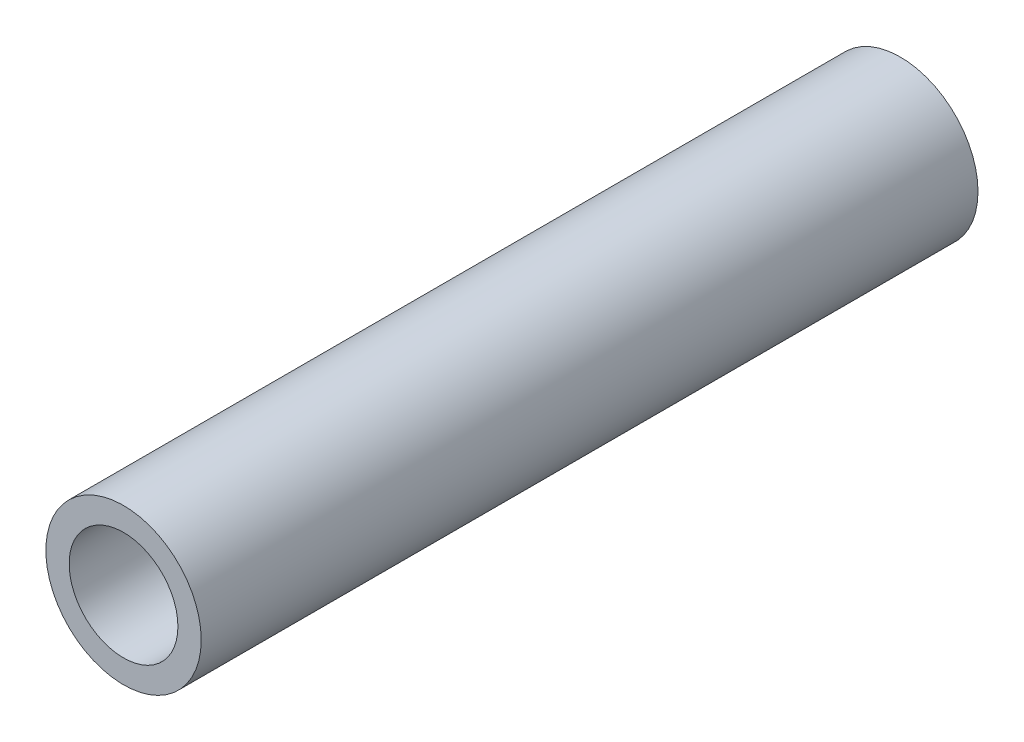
ISO-10303-21;
HEADER;
FILE_DESCRIPTION(('STEP AP214'),'2;1');
FILE_NAME('part.step','',(''),(''),'','','');
FILE_SCHEMA(('AUTOMOTIVE_DESIGN { 1 0 10303 214 1 1 1 1 }'));
ENDSEC;
DATA;
#1=APPLICATION_CONTEXT('core data for automotive mechanical design processes');
#2=APPLICATION_PROTOCOL_DEFINITION('international standard','automotive_design',2000,#1);
#3=PRODUCT_CONTEXT('',#1,'mechanical');
#4=PRODUCT('Part','Part','',(#3));
#5=PRODUCT_RELATED_PRODUCT_CATEGORY('part','',(#4));
#6=PRODUCT_DEFINITION_FORMATION('','',#4);
#7=PRODUCT_DEFINITION_CONTEXT('part definition',#1,'design');
#8=PRODUCT_DEFINITION('design','',#6,#7);
#9=PRODUCT_DEFINITION_SHAPE('','',#8);
#10=(LENGTH_UNIT() NAMED_UNIT(*) SI_UNIT(.MILLI.,.METRE.));
#11=(NAMED_UNIT(*) PLANE_ANGLE_UNIT() SI_UNIT($,.RADIAN.));
#12=(NAMED_UNIT(*) SI_UNIT($,.STERADIAN.) SOLID_ANGLE_UNIT());
#13=UNCERTAINTY_MEASURE_WITH_UNIT(LENGTH_MEASURE(1.E-05),#10,'distance_accuracy_value','');
#14=(GEOMETRIC_REPRESENTATION_CONTEXT(3) GLOBAL_UNCERTAINTY_ASSIGNED_CONTEXT((#13)) GLOBAL_UNIT_ASSIGNED_CONTEXT((#10,
#11,#12)) REPRESENTATION_CONTEXT('',''));
#15=CARTESIAN_POINT('',(0.,0.,0.));
#16=DIRECTION('',(0.,0.,1.));
#17=DIRECTION('',(1.,0.,0.));
#18=AXIS2_PLACEMENT_3D('',#15,#16,#17);
#19=CARTESIAN_POINT('',(0.,0.,50.));
#20=DIRECTION('',(0.,0.,1.));
#21=DIRECTION('',(1.,0.,0.));
#22=AXIS2_PLACEMENT_3D('',#19,#20,#21);
#23=PLANE('',#22);
#24=CARTESIAN_POINT('',(0.,0.,50.));
#25=DIRECTION('',(0.,0.,1.));
#26=DIRECTION('',(1.,0.,0.));
#27=AXIS2_PLACEMENT_3D('',#24,#25,#26);
#28=CIRCLE('',#27,5.);
#29=CARTESIAN_POINT('',(5.,0.,50.));
#30=VERTEX_POINT('',#29);
#31=EDGE_CURVE('E10',#30,#30,#28,.T.);
#32=ORIENTED_EDGE('',*,*,#31,.T.);
#33=EDGE_LOOP('',(#32));
#34=FACE_BOUND('',#33,.T.);
#35=CARTESIAN_POINT('',(0.,0.,50.));
#36=DIRECTION('',(0.,0.,1.));
#37=DIRECTION('',(1.,0.,0.));
#38=AXIS2_PLACEMENT_3D('',#35,#36,#37);
#39=CIRCLE('',#38,3.5);
#40=CARTESIAN_POINT('',(3.5,0.,50.));
#41=VERTEX_POINT('',#40);
#42=EDGE_CURVE('E43',#41,#41,#39,.T.);
#43=ORIENTED_EDGE('',*,*,#42,.F.);
#44=EDGE_LOOP('',(#43));
#45=FACE_BOUND('',#44,.T.);
#46=ADVANCED_FACE('F32',(#34,#45),#23,.T.);
#47=CARTESIAN_POINT('',(0.,0.,0.));
#48=DIRECTION('',(0.,0.,1.));
#49=DIRECTION('',(1.,0.,0.));
#50=AXIS2_PLACEMENT_3D('',#47,#48,#49);
#51=PLANE('',#50);
#52=CARTESIAN_POINT('',(0.,0.,0.));
#53=DIRECTION('',(0.,0.,1.));
#54=DIRECTION('',(1.,0.,0.));
#55=AXIS2_PLACEMENT_3D('',#52,#53,#54);
#56=CIRCLE('',#55,5.);
#57=CARTESIAN_POINT('',(5.,0.,0.));
#58=VERTEX_POINT('',#57);
#59=EDGE_CURVE('E36',#58,#58,#56,.T.);
#60=ORIENTED_EDGE('',*,*,#59,.F.);
#61=EDGE_LOOP('',(#60));
#62=FACE_BOUND('',#61,.T.);
#63=CARTESIAN_POINT('',(0.,0.,0.));
#64=DIRECTION('',(0.,0.,1.));
#65=DIRECTION('',(1.,0.,0.));
#66=AXIS2_PLACEMENT_3D('',#63,#64,#65);
#67=CIRCLE('',#66,3.5);
#68=CARTESIAN_POINT('',(3.5,0.,0.));
#69=VERTEX_POINT('',#68);
#70=EDGE_CURVE('E45',#69,#69,#67,.T.);
#71=ORIENTED_EDGE('',*,*,#70,.T.);
#72=EDGE_LOOP('',(#71));
#73=FACE_BOUND('',#72,.T.);
#74=ADVANCED_FACE('F55',(#62,#73),#51,.F.);
#75=CARTESIAN_POINT('',(0.,0.,50.));
#76=DIRECTION('',(0.,0.,-1.));
#77=DIRECTION('',(-1.,0.,0.));
#78=AXIS2_PLACEMENT_3D('',#75,#76,#77);
#79=CYLINDRICAL_SURFACE('',#78,5.);
#80=ORIENTED_EDGE('',*,*,#31,.F.);
#81=EDGE_LOOP('',(#80));
#82=FACE_BOUND('',#81,.T.);
#83=ORIENTED_EDGE('',*,*,#59,.T.);
#84=EDGE_LOOP('',(#83));
#85=FACE_BOUND('',#84,.T.);
#86=ADVANCED_FACE('F34',(#82,#85),#79,.T.);
#87=CARTESIAN_POINT('',(0.,0.,50.));
#88=DIRECTION('',(0.,0.,-1.));
#89=DIRECTION('',(-1.,0.,0.));
#90=AXIS2_PLACEMENT_3D('',#87,#88,#89);
#91=CYLINDRICAL_SURFACE('',#90,3.5);
#92=ORIENTED_EDGE('',*,*,#42,.T.);
#93=EDGE_LOOP('',(#92));
#94=FACE_BOUND('',#93,.T.);
#95=ORIENTED_EDGE('',*,*,#70,.F.);
#96=EDGE_LOOP('',(#95));
#97=FACE_BOUND('',#96,.T.);
#98=ADVANCED_FACE('F51',(#94,#97),#91,.F.);
#99=CLOSED_SHELL('',(#46,#74,#86,#98));
#100=MANIFOLD_SOLID_BREP('B2',#99);
#101=ADVANCED_BREP_SHAPE_REPRESENTATION('',(#18,#100),#14);
#102=SHAPE_DEFINITION_REPRESENTATION(#9,#101);
ENDSEC;
END-ISO-10303-21;
